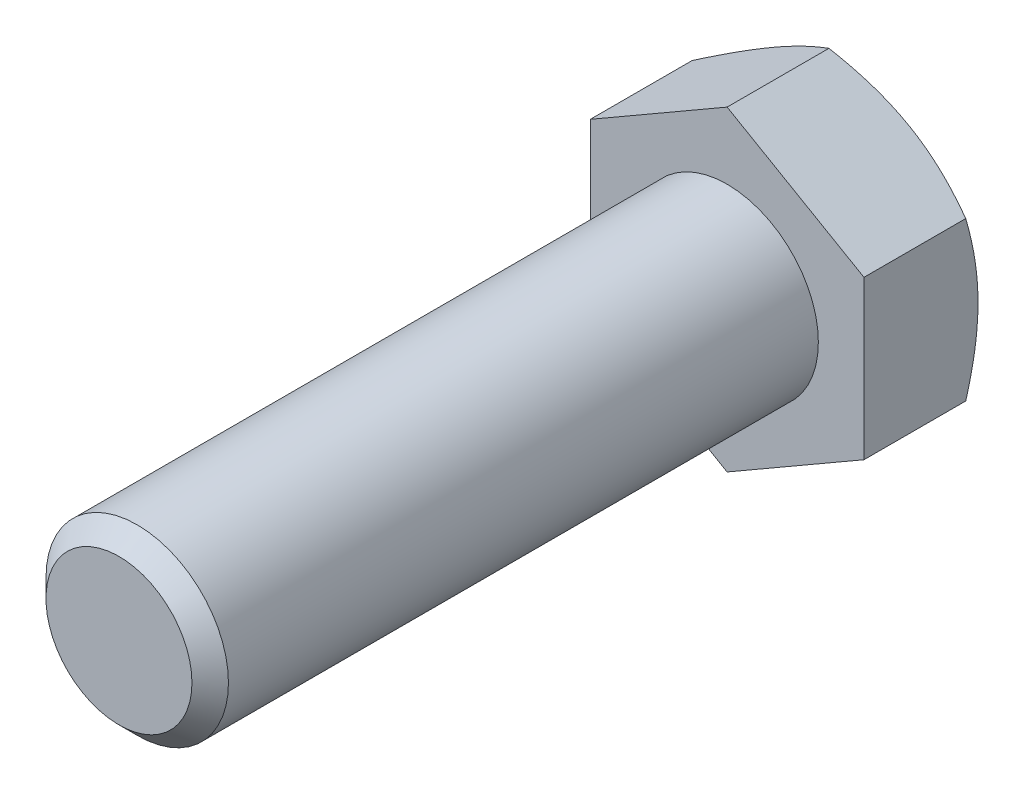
ISO-10303-21;
HEADER;
FILE_DESCRIPTION(('STEP AP214'),'2;1');
FILE_NAME('part.step','',(''),(''),'','','');
FILE_SCHEMA(('AUTOMOTIVE_DESIGN { 1 0 10303 214 1 1 1 1 }'));
ENDSEC;
DATA;
#1=APPLICATION_CONTEXT('core data for automotive mechanical design processes');
#2=APPLICATION_PROTOCOL_DEFINITION('international standard','automotive_design',2000,#1);
#3=PRODUCT_CONTEXT('',#1,'mechanical');
#4=PRODUCT('Part','Part','',(#3));
#5=PRODUCT_RELATED_PRODUCT_CATEGORY('part','',(#4));
#6=PRODUCT_DEFINITION_FORMATION('','',#4);
#7=PRODUCT_DEFINITION_CONTEXT('part definition',#1,'design');
#8=PRODUCT_DEFINITION('design','',#6,#7);
#9=PRODUCT_DEFINITION_SHAPE('','',#8);
#10=(LENGTH_UNIT() NAMED_UNIT(*) SI_UNIT(.MILLI.,.METRE.));
#11=(NAMED_UNIT(*) PLANE_ANGLE_UNIT() SI_UNIT($,.RADIAN.));
#12=(NAMED_UNIT(*) SI_UNIT($,.STERADIAN.) SOLID_ANGLE_UNIT());
#13=UNCERTAINTY_MEASURE_WITH_UNIT(LENGTH_MEASURE(1.E-05),#10,'distance_accuracy_value','');
#14=(GEOMETRIC_REPRESENTATION_CONTEXT(3) GLOBAL_UNCERTAINTY_ASSIGNED_CONTEXT((#13)) GLOBAL_UNIT_ASSIGNED_CONTEXT((#10,
#11,#12)) REPRESENTATION_CONTEXT('',''));
#15=CARTESIAN_POINT('',(0.,0.,0.));
#16=DIRECTION('',(0.,0.,1.));
#17=DIRECTION('',(1.,0.,0.));
#18=AXIS2_PLACEMENT_3D('',#15,#16,#17);
#19=CARTESIAN_POINT('',(0.,0.,40.));
#20=DIRECTION('',(0.,0.,1.));
#21=DIRECTION('',(1.,0.,0.));
#22=AXIS2_PLACEMENT_3D('',#19,#20,#21);
#23=PLANE('',#22);
#24=CARTESIAN_POINT('',(0.,0.,40.));
#25=DIRECTION('',(0.,0.,1.));
#26=DIRECTION('',(1.,0.,0.));
#27=AXIS2_PLACEMENT_3D('',#24,#25,#26);
#28=CIRCLE('',#27,4.8);
#29=CARTESIAN_POINT('',(4.80000000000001,0.,40.));
#30=VERTEX_POINT('',#29);
#31=EDGE_CURVE('E214',#30,#30,#28,.T.);
#32=ORIENTED_EDGE('',*,*,#31,.T.);
#33=EDGE_LOOP('',(#32));
#34=FACE_BOUND('',#33,.T.);
#35=ADVANCED_FACE('F34',(#34),#23,.T.);
#36=CARTESIAN_POINT('',(0.,0.,0.));
#37=DIRECTION('',(0.,0.,1.));
#38=DIRECTION('',(1.,0.,0.));
#39=AXIS2_PLACEMENT_3D('',#36,#37,#38);
#40=CYLINDRICAL_SURFACE('',#39,6.);
#41=CARTESIAN_POINT('',(0.,0.,38.8));
#42=DIRECTION('',(0.,0.,1.));
#43=DIRECTION('',(1.,0.,0.));
#44=AXIS2_PLACEMENT_3D('',#41,#42,#43);
#45=CIRCLE('',#44,6.);
#46=CARTESIAN_POINT('',(6.,0.,38.8));
#47=VERTEX_POINT('',#46);
#48=EDGE_CURVE('E216',#47,#47,#45,.F.);
#49=ORIENTED_EDGE('',*,*,#48,.T.);
#50=EDGE_LOOP('',(#49));
#51=FACE_BOUND('',#50,.T.);
#52=CARTESIAN_POINT('',(0.,0.,0.));
#53=DIRECTION('',(0.,0.,1.));
#54=DIRECTION('',(1.,0.,0.));
#55=AXIS2_PLACEMENT_3D('',#52,#53,#54);
#56=CIRCLE('',#55,6.);
#57=CARTESIAN_POINT('',(6.,0.,0.));
#58=VERTEX_POINT('',#57);
#59=EDGE_CURVE('E217',#58,#58,#56,.F.);
#60=ORIENTED_EDGE('',*,*,#59,.F.);
#61=EDGE_LOOP('',(#60));
#62=FACE_BOUND('',#61,.T.);
#63=ADVANCED_FACE('F205',(#51,#62),#40,.T.);
#64=CARTESIAN_POINT('',(0.,0.,40.));
#65=DIRECTION('',(0.,0.,-1.));
#66=DIRECTION('',(-1.,0.,0.));
#67=AXIS2_PLACEMENT_3D('',#64,#65,#66);
#68=CONICAL_SURFACE('',#67,4.8,0.785398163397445);
#69=ORIENTED_EDGE('',*,*,#48,.F.);
#70=EDGE_LOOP('',(#69));
#71=FACE_BOUND('',#70,.T.);
#72=ORIENTED_EDGE('',*,*,#31,.F.);
#73=EDGE_LOOP('',(#72));
#74=FACE_BOUND('',#73,.T.);
#75=ADVANCED_FACE('F210',(#71,#74),#68,.T.);
#76=CARTESIAN_POINT('',(0.,10.3923048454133,-7.5));
#77=DIRECTION('',(0.499999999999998,0.86602540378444,0.));
#78=DIRECTION('',(-0.86602540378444,0.499999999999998,0.));
#79=AXIS2_PLACEMENT_3D('',#76,#77,#78);
#80=PLANE('',#79);
#81=CARTESIAN_POINT('',(-0.000200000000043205,10.3924203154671,-6.69608575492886));
#82=CARTESIAN_POINT('',(0.197607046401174,10.2782163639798,-6.76201799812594));
#83=CARTESIAN_POINT('',(0.396185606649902,10.1635669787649,-6.82495859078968));
#84=CARTESIAN_POINT('',(0.794955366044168,9.93333715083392,-6.94403100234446));
#85=CARTESIAN_POINT('',(0.99514722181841,9.81775632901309,-7.00015988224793));
#86=CARTESIAN_POINT('',(1.39751505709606,9.58544915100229,-7.10484803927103));
#87=CARTESIAN_POINT('',(1.59969459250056,9.46872074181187,-7.15338922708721));
#88=CARTESIAN_POINT('',(2.00542875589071,9.23447001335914,-7.24185148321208));
#89=CARTESIAN_POINT('',(2.20898309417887,9.11694786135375,-7.28177431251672));
#90=CARTESIAN_POINT('',(2.61230590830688,8.88408932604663,-7.35131532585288));
#91=CARTESIAN_POINT('',(2.81204459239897,8.76877014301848,-7.3811624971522));
#92=CARTESIAN_POINT('',(3.21241567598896,8.53761579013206,-7.43120669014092));
#93=CARTESIAN_POINT('',(3.41304799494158,8.42178066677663,-7.45140456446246));
#94=CARTESIAN_POINT('',(3.81466063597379,8.18990950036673,-7.48164565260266));
#95=CARTESIAN_POINT('',(4.01564030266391,8.07387383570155,-7.4917003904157));
#96=CARTESIAN_POINT('',(4.4177845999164,7.84169571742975,-7.50143766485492));
#97=CARTESIAN_POINT('',(4.6189492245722,7.7255532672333,-7.50112052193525));
#98=CARTESIAN_POINT('',(4.99503261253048,7.50842142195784,-7.49083604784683));
#99=CARTESIAN_POINT('',(5.16997789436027,7.40741671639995,-7.48212325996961));
#100=CARTESIAN_POINT('',(5.51945867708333,7.2056438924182,-7.45702265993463));
#101=CARTESIAN_POINT('',(5.69399414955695,7.10487579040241,-7.44063433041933));
#102=CARTESIAN_POINT('',(6.21692487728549,6.80296159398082,-7.38034344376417));
#103=CARTESIAN_POINT('',(6.5643945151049,6.60234990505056,-7.32532251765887));
#104=CARTESIAN_POINT('',(7.26301962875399,6.19899850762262,-7.18776952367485));
#105=CARTESIAN_POINT('',(7.61408594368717,5.99631027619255,-7.10465438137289));
#106=CARTESIAN_POINT('',(8.3109833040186,5.59395639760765,-6.91601746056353));
#107=CARTESIAN_POINT('',(8.65682327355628,5.39428559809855,-6.81053998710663));
#108=CARTESIAN_POINT('',(9.0002,5.19603695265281,-6.69608575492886));
#109=B_SPLINE_CURVE_WITH_KNOTS('',3,(#81,#82,#83,#84,#85,#86,#87,#88,#89,#90,#91,#92,#93,#94,
#95,#96,#97,#98,#99,#100,#101,#102,#103,#104,#105,#106,#107,#108),.UNSPECIFIED.,.F.,.F.,(4,2,2,
2,2,2,2,2,2,2,2,2,2,4),(0.,0.713219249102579,1.42674513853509,2.14194697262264,2.85700253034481,
3.55449749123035,4.25193080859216,4.94857085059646,5.64518936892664,6.25162976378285,
6.85811104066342,8.07193747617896,9.31268391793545,10.5509947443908),.UNSPECIFIED.);
#110=CARTESIAN_POINT('',(0.,10.3923048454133,-6.69615242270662));
#111=VERTEX_POINT('',#110);
#112=CARTESIAN_POINT('',(4.49999999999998,7.79422863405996,-7.5));
#113=VERTEX_POINT('',#112);
#114=EDGE_CURVE('E250',#111,#113,#109,.T.);
#115=ORIENTED_EDGE('',*,*,#114,.F.);
#116=DIRECTION('',(0.,0.,1.));
#117=VECTOR('',#116,1.);
#118=CARTESIAN_POINT('',(0.,10.3923048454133,-7.5));
#119=LINE('',#118,#117);
#120=CARTESIAN_POINT('',(0.,10.3923048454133,0.));
#121=VERTEX_POINT('',#120);
#122=EDGE_CURVE('E224',#111,#121,#119,.T.);
#123=ORIENTED_EDGE('',*,*,#122,.T.);
#124=DIRECTION('',(-0.86602540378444,0.499999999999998,0.));
#125=VECTOR('',#124,1.);
#126=CARTESIAN_POINT('',(0.,10.3923048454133,0.));
#127=LINE('',#126,#125);
#128=CARTESIAN_POINT('',(9.,5.19615242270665,0.));
#129=VERTEX_POINT('',#128);
#130=EDGE_CURVE('E248',#129,#121,#127,.T.);
#131=ORIENTED_EDGE('',*,*,#130,.F.);
#132=DIRECTION('',(0.,0.,1.));
#133=VECTOR('',#132,1.);
#134=CARTESIAN_POINT('',(9.,5.19615242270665,-7.5));
#135=LINE('',#134,#133);
#136=CARTESIAN_POINT('',(9.,5.19615242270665,-6.69615242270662));
#137=VERTEX_POINT('',#136);
#138=EDGE_CURVE('E221',#137,#129,#135,.T.);
#139=ORIENTED_EDGE('',*,*,#138,.F.);
#140=EDGE_CURVE('E179',#113,#137,#109,.T.);
#141=ORIENTED_EDGE('',*,*,#140,.F.);
#142=EDGE_LOOP('',(#115,#123,#131,#139,#141));
#143=FACE_BOUND('',#142,.T.);
#144=ADVANCED_FACE('F190',(#143),#80,.T.);
#145=CARTESIAN_POINT('',(9.,-5.19615242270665,-7.5));
#146=DIRECTION('',(1.,0.,0.));
#147=DIRECTION('',(0.,0.,-1.));
#148=AXIS2_PLACEMENT_3D('',#145,#146,#147);
#149=PLANE('',#148);
#150=CARTESIAN_POINT('',(9.,-14.1938054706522,-2.9928177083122));
#151=CARTESIAN_POINT('',(9.,-13.7986249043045,-3.18545400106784));
#152=CARTESIAN_POINT('',(9.,-13.4025620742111,-3.37631016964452));
#153=CARTESIAN_POINT('',(9.,-12.6082034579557,-3.75346543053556));
#154=CARTESIAN_POINT('',(9.,-12.2099073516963,-3.93976384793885));
#155=CARTESIAN_POINT('',(9.,-11.4086732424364,-4.30769386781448));
#156=CARTESIAN_POINT('',(9.,-11.005721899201,-4.48929651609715));
#157=CARTESIAN_POINT('',(9.,-10.1966954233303,-4.84537774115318));
#158=CARTESIAN_POINT('',(9.,-9.79062043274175,-5.01985663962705));
#159=CARTESIAN_POINT('',(9.,-8.96081603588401,-5.36560228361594));
#160=CARTESIAN_POINT('',(9.,-8.53695616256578,-5.53655757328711));
#161=CARTESIAN_POINT('',(9.,-7.68436682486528,-5.86609252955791));
#162=CARTESIAN_POINT('',(9.,-7.25563683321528,-6.02467084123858));
#163=CARTESIAN_POINT('',(9.,-6.39334839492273,-6.3254614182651));
#164=CARTESIAN_POINT('',(9.,-5.95980093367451,-6.46770484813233));
#165=CARTESIAN_POINT('',(9.,-5.08650675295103,-6.73142002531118));
#166=CARTESIAN_POINT('',(9.,-4.64676195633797,-6.85289806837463));
#167=CARTESIAN_POINT('',(9.,-3.76318857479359,-7.06875933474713));
#168=CARTESIAN_POINT('',(9.,-3.31939822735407,-7.16329494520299));
#169=CARTESIAN_POINT('',(9.,-2.64948950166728,-7.28091249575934));
#170=CARTESIAN_POINT('',(9.,-2.42546830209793,-7.31608884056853));
#171=CARTESIAN_POINT('',(9.,-1.97623392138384,-7.37769613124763));
#172=CARTESIAN_POINT('',(9.,-1.75102085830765,-7.40412792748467));
#173=CARTESIAN_POINT('',(9.,-1.3027498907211,-7.44737513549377));
#174=CARTESIAN_POINT('',(9.,-1.07970414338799,-7.46431601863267));
#175=CARTESIAN_POINT('',(9.,-0.633095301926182,-7.4887410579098));
#176=CARTESIAN_POINT('',(9.,-0.409532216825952,-7.49622537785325));
#177=CARTESIAN_POINT('',(9.,0.0377121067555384,-7.50155767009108));
#178=CARTESIAN_POINT('',(9.,0.261393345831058,-7.49940559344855));
#179=CARTESIAN_POINT('',(9.,0.708460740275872,-7.48552018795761));
#180=CARTESIAN_POINT('',(9.,0.931846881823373,-7.47378642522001));
#181=CARTESIAN_POINT('',(9.,1.46162752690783,-7.43485039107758));
#182=CARTESIAN_POINT('',(9.,1.76772399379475,-7.40349650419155));
#183=CARTESIAN_POINT('',(9.,2.37778404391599,-7.32445593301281));
#184=CARTESIAN_POINT('',(9.,2.6817473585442,-7.27676722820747));
#185=CARTESIAN_POINT('',(9.,3.59000335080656,-7.1117163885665));
#186=CARTESIAN_POINT('',(9.,4.19036603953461,-6.9723942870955));
#187=CARTESIAN_POINT('',(9.,5.08858153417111,-6.72898039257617));
#188=CARTESIAN_POINT('',(9.,5.39104017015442,-6.64089135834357));
#189=CARTESIAN_POINT('',(9.,5.99302412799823,-6.4551143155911));
#190=CARTESIAN_POINT('',(9.,6.29254942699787,-6.35742623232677));
#191=CARTESIAN_POINT('',(9.,6.88875586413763,-6.15405553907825));
#192=CARTESIAN_POINT('',(9.,7.18543776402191,-6.0483751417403));
#193=CARTESIAN_POINT('',(9.,7.77631041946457,-5.83030807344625));
#194=CARTESIAN_POINT('',(9.,8.07050123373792,-5.71792156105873));
#195=CARTESIAN_POINT('',(9.,8.86768097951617,-5.40462740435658));
#196=CARTESIAN_POINT('',(9.,9.36851420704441,-5.19823951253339));
#197=CARTESIAN_POINT('',(9.,10.3649647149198,-4.77318997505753));
#198=CARTESIAN_POINT('',(9.,10.860581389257,-4.5545269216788));
#199=CARTESIAN_POINT('',(9.,11.8478077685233,-4.10785524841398));
#200=CARTESIAN_POINT('',(9.,12.3394158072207,-3.87984295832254));
#201=CARTESIAN_POINT('',(9.,13.3192435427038,-3.41672758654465));
#202=CARTESIAN_POINT('',(9.,13.8074633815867,-3.18162480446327));
#203=CARTESIAN_POINT('',(9.,14.7819931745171,-2.70549247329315));
#204=CARTESIAN_POINT('',(9.,15.2682986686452,-2.46445381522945));
#205=CARTESIAN_POINT('',(9.,16.2387067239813,-1.97797920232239));
#206=CARTESIAN_POINT('',(9.,16.722809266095,-1.73254320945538));
#207=CARTESIAN_POINT('',(9.,17.6890969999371,-1.23819989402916));
#208=CARTESIAN_POINT('',(9.,18.1712826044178,-0.98929337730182));
#209=CARTESIAN_POINT('',(9.,19.1341609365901,-0.488607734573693));
#210=CARTESIAN_POINT('',(9.,19.6148536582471,-0.236828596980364));
#211=CARTESIAN_POINT('',(9.,20.9522159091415,0.467839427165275));
#212=CARTESIAN_POINT('',(9.,21.8075292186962,0.923301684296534));
#213=CARTESIAN_POINT('',(9.,23.5152984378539,1.83966951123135));
#214=CARTESIAN_POINT('',(9.,24.3677541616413,2.30057542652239));
#215=CARTESIAN_POINT('',(9.,26.0675482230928,3.22485857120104));
#216=CARTESIAN_POINT('',(9.,26.9148940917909,3.68822195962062));
#217=CARTESIAN_POINT('',(9.,28.1846057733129,4.38556367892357));
#218=CARTESIAN_POINT('',(9.,28.6076082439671,4.61838432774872));
#219=CARTESIAN_POINT('',(9.,29.4532343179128,5.08471147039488));
#220=CARTESIAN_POINT('',(9.,29.8758579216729,5.31821796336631));
#221=CARTESIAN_POINT('',(9.,30.2983153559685,5.55202477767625));
#222=B_SPLINE_CURVE_WITH_KNOTS('',3,(#150,#151,#152,#153,#154,#155,#156,#157,#158,#159,#160,
#161,#162,#163,#164,#165,#166,#167,#168,#169,#170,#171,#172,#173,#174,#175,#176,#177,#178,#179,
#180,#181,#182,#183,#184,#185,#186,#187,#188,#189,#190,#191,#192,#193,#194,#195,#196,#197,#198,
#199,#200,#201,#202,#203,#204,#205,#206,#207,#208,#209,#210,#211,#212,#213,#214,#215,#216,#217,
#218,#219,#220,#221),.UNSPECIFIED.,.F.,.F.,(4,2,2,2,2,2,2,2,2,2,2,2,2,2,2,2,2,2,2,2,2,2,2,2,2,2,
2,2,2,2,2,2,2,2,2,4),(0.,1.31891143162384,2.63801699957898,3.9639117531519,5.28974656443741,
6.66070766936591,8.03181864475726,9.40026868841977,10.7683030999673,12.1284389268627,
12.8085936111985,13.488682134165,14.1595537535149,14.8304137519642,15.5012771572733,
16.172170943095,17.094749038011,18.0174412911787,19.8637129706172,20.808703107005,
21.7537006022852,22.6984374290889,23.6431519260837,25.267980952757,26.8929966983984,
28.5186565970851,30.1442479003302,31.7725119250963,33.400790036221,35.0286961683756,
36.6566088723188,39.5636489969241,42.4708746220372,45.3681585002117,46.8166845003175,
48.2652087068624),.UNSPECIFIED.);
#223=CARTESIAN_POINT('',(9.,0.,-7.5));
#224=VERTEX_POINT('',#223);
#225=EDGE_CURVE('E177',#137,#224,#222,.F.);
#226=ORIENTED_EDGE('',*,*,#225,.F.);
#227=ORIENTED_EDGE('',*,*,#138,.T.);
#228=DIRECTION('',(0.,1.,0.));
#229=VECTOR('',#228,1.);
#230=CARTESIAN_POINT('',(9.,-5.19615242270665,0.));
#231=LINE('',#230,#229);
#232=CARTESIAN_POINT('',(9.,-5.19615242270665,0.));
#233=VERTEX_POINT('',#232);
#234=EDGE_CURVE('E226',#233,#129,#231,.T.);
#235=ORIENTED_EDGE('',*,*,#234,.F.);
#236=DIRECTION('',(0.,0.,1.));
#237=VECTOR('',#236,1.);
#238=CARTESIAN_POINT('',(9.,-5.19615242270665,-7.5));
#239=LINE('',#238,#237);
#240=CARTESIAN_POINT('',(9.,-5.19615242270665,-6.69615242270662));
#241=VERTEX_POINT('',#240);
#242=EDGE_CURVE('E232',#241,#233,#239,.T.);
#243=ORIENTED_EDGE('',*,*,#242,.F.);
#244=EDGE_CURVE('E171',#224,#241,#222,.F.);
#245=ORIENTED_EDGE('',*,*,#244,.F.);
#246=EDGE_LOOP('',(#226,#227,#235,#243,#245));
#247=FACE_BOUND('',#246,.T.);
#248=ADVANCED_FACE('F186',(#247),#149,.T.);
#249=CARTESIAN_POINT('',(0.,-10.3923048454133,-7.5));
#250=DIRECTION('',(0.499999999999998,-0.86602540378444,0.));
#251=DIRECTION('',(0.86602540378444,0.499999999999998,0.));
#252=AXIS2_PLACEMENT_3D('',#249,#250,#251);
#253=PLANE('',#252);
#254=CARTESIAN_POINT('',(9.0002,-5.19603695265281,-6.69608575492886));
#255=CARTESIAN_POINT('',(8.80239295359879,-5.31024090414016,-6.76201799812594));
#256=CARTESIAN_POINT('',(8.60381439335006,-5.42489028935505,-6.82495859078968));
#257=CARTESIAN_POINT('',(8.20504463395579,-5.65512011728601,-6.94403100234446));
#258=CARTESIAN_POINT('',(8.00485277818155,-5.77070093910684,-7.00015988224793));
#259=CARTESIAN_POINT('',(7.6024849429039,-6.00300811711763,-7.10484803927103));
#260=CARTESIAN_POINT('',(7.4003054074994,-6.11973652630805,-7.15338922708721));
#261=CARTESIAN_POINT('',(6.99457124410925,-6.35398725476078,-7.24185148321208));
#262=CARTESIAN_POINT('',(6.79101690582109,-6.47150940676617,-7.28177431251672));
#263=CARTESIAN_POINT('',(6.38769409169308,-6.70436794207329,-7.35131532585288));
#264=CARTESIAN_POINT('',(6.18795540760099,-6.81968712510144,-7.3811624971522));
#265=CARTESIAN_POINT('',(5.787584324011,-7.05084147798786,-7.43120669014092));
#266=CARTESIAN_POINT('',(5.58695200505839,-7.16667660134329,-7.45140456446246));
#267=CARTESIAN_POINT('',(5.18533936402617,-7.3985477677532,-7.48164565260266));
#268=CARTESIAN_POINT('',(4.98435969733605,-7.51458343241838,-7.4917003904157));
#269=CARTESIAN_POINT('',(4.58221540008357,-7.74676155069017,-7.50143766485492));
#270=CARTESIAN_POINT('',(4.38105077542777,-7.86290400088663,-7.50112052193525));
#271=CARTESIAN_POINT('',(4.00496738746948,-8.08003584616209,-7.49083604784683));
#272=CARTESIAN_POINT('',(3.83002210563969,-8.18104055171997,-7.48212325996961));
#273=CARTESIAN_POINT('',(3.48054132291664,-8.38281337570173,-7.45702265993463));
#274=CARTESIAN_POINT('',(3.30600585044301,-8.48358147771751,-7.44063433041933));
#275=CARTESIAN_POINT('',(2.78307512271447,-8.78549567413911,-7.38034344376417));
#276=CARTESIAN_POINT('',(2.43560548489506,-8.98610736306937,-7.32532251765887));
#277=CARTESIAN_POINT('',(1.73698037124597,-9.3894587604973,-7.18776952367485));
#278=CARTESIAN_POINT('',(1.3859140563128,-9.59214699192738,-7.10465438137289));
#279=CARTESIAN_POINT('',(0.689016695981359,-9.99450087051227,-6.91601746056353));
#280=CARTESIAN_POINT('',(0.343176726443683,-10.1941716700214,-6.81053998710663));
#281=CARTESIAN_POINT('',(-0.000200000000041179,-10.3924203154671,-6.69608575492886));
#282=B_SPLINE_CURVE_WITH_KNOTS('',3,(#254,#255,#256,#257,#258,#259,#260,#261,#262,#263,#264,
#265,#266,#267,#268,#269,#270,#271,#272,#273,#274,#275,#276,#277,#278,#279,#280,#281),
.UNSPECIFIED.,.F.,.F.,(4,2,2,2,2,2,2,2,2,2,2,2,2,4),(0.,0.713219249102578,1.42674513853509,
2.14194697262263,2.85700253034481,3.55449749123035,4.25193080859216,4.94857085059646,
5.64518936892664,6.25162976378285,6.85811104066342,8.07193747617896,9.31268391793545,
10.5509947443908),.UNSPECIFIED.);
#283=CARTESIAN_POINT('',(4.49999999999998,-7.79422863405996,-7.5));
#284=VERTEX_POINT('',#283);
#285=EDGE_CURVE('E178',#241,#284,#282,.T.);
#286=ORIENTED_EDGE('',*,*,#285,.F.);
#287=ORIENTED_EDGE('',*,*,#242,.T.);
#288=DIRECTION('',(0.86602540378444,0.499999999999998,0.));
#289=VECTOR('',#288,1.);
#290=CARTESIAN_POINT('',(0.,-10.3923048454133,0.));
#291=LINE('',#290,#289);
#292=CARTESIAN_POINT('',(0.,-10.3923048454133,0.));
#293=VERTEX_POINT('',#292);
#294=EDGE_CURVE('E237',#293,#233,#291,.T.);
#295=ORIENTED_EDGE('',*,*,#294,.F.);
#296=DIRECTION('',(0.,0.,1.));
#297=VECTOR('',#296,1.);
#298=CARTESIAN_POINT('',(0.,-10.3923048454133,-7.5));
#299=LINE('',#298,#297);
#300=CARTESIAN_POINT('',(0.,-10.3923048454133,-6.69615242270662));
#301=VERTEX_POINT('',#300);
#302=EDGE_CURVE('E230',#301,#293,#299,.T.);
#303=ORIENTED_EDGE('',*,*,#302,.F.);
#304=EDGE_CURVE('E164',#284,#301,#282,.T.);
#305=ORIENTED_EDGE('',*,*,#304,.F.);
#306=EDGE_LOOP('',(#286,#287,#295,#303,#305));
#307=FACE_BOUND('',#306,.T.);
#308=ADVANCED_FACE('F189',(#307),#253,.T.);
#309=CARTESIAN_POINT('',(0.,-10.3923048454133,-7.5));
#310=DIRECTION('',(-0.500000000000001,-0.866025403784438,0.));
#311=DIRECTION('',(0.866025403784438,-0.500000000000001,0.));
#312=AXIS2_PLACEMENT_3D('',#309,#310,#311);
#313=PLANE('',#312);
#314=CARTESIAN_POINT('',(0.000199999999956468,-10.3924203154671,-6.69608575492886));
#315=CARTESIAN_POINT('',(-0.19760704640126,-10.2782163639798,-6.76201799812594));
#316=CARTESIAN_POINT('',(-0.396185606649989,-10.1635669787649,-6.82495859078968));
#317=CARTESIAN_POINT('',(-0.794955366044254,-9.93333715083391,-6.94403100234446));
#318=CARTESIAN_POINT('',(-0.995147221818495,-9.81775632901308,-7.00015988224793));
#319=CARTESIAN_POINT('',(-1.39751505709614,-9.58544915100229,-7.10484803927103));
#320=CARTESIAN_POINT('',(-1.59969459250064,-9.46872074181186,-7.15338922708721));
#321=CARTESIAN_POINT('',(-2.00542875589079,-9.23447001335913,-7.24185148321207));
#322=CARTESIAN_POINT('',(-2.20898309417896,-9.11694786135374,-7.28177431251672));
#323=CARTESIAN_POINT('',(-2.61230590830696,-8.88408932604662,-7.35131532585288));
#324=CARTESIAN_POINT('',(-2.81204459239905,-8.76877014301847,-7.38116249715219));
#325=CARTESIAN_POINT('',(-3.21241567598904,-8.53761579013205,-7.43120669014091));
#326=CARTESIAN_POINT('',(-3.41304799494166,-8.42178066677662,-7.45140456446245));
#327=CARTESIAN_POINT('',(-3.81466063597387,-8.18990950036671,-7.48164565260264));
#328=CARTESIAN_POINT('',(-4.01564030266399,-8.07387383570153,-7.49170039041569));
#329=CARTESIAN_POINT('',(-4.41778459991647,-7.84169571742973,-7.50143766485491));
#330=CARTESIAN_POINT('',(-4.61894922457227,-7.72555326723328,-7.50112052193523));
#331=CARTESIAN_POINT('',(-4.99503261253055,-7.50842142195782,-7.49083604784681));
#332=CARTESIAN_POINT('',(-5.16997789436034,-7.40741671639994,-7.48212325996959));
#333=CARTESIAN_POINT('',(-5.51945867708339,-7.20564389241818,-7.45702265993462));
#334=CARTESIAN_POINT('',(-5.69399414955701,-7.10487579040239,-7.44063433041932));
#335=CARTESIAN_POINT('',(-6.21692487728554,-6.8029615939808,-7.38034344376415));
#336=CARTESIAN_POINT('',(-6.56439451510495,-6.60234990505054,-7.32532251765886));
#337=CARTESIAN_POINT('',(-7.26301962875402,-6.19899850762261,-7.18776952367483));
#338=CARTESIAN_POINT('',(-7.61408594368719,-5.99631027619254,-7.10465438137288));
#339=CARTESIAN_POINT('',(-8.31098330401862,-5.59395639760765,-6.91601746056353));
#340=CARTESIAN_POINT('',(-8.65682327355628,-5.39428559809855,-6.81053998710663));
#341=CARTESIAN_POINT('',(-9.0002,-5.19603695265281,-6.69608575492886));
#342=B_SPLINE_CURVE_WITH_KNOTS('',3,(#314,#315,#316,#317,#318,#319,#320,#321,#322,#323,#324,
#325,#326,#327,#328,#329,#330,#331,#332,#333,#334,#335,#336,#337,#338,#339,#340,#341),
.UNSPECIFIED.,.F.,.F.,(4,2,2,2,2,2,2,2,2,2,2,2,2,4),(0.,0.71321924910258,1.42674513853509,
2.14194697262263,2.85700253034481,3.55449749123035,4.25193080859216,4.94857085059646,
5.64518936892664,6.25162976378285,6.85811104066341,8.07193747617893,9.31268391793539,
10.5509947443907),.UNSPECIFIED.);
#343=CARTESIAN_POINT('',(-4.50000000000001,-7.79422863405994,-7.5));
#344=VERTEX_POINT('',#343);
#345=EDGE_CURVE('E269',#301,#344,#342,.T.);
#346=ORIENTED_EDGE('',*,*,#345,.F.);
#347=ORIENTED_EDGE('',*,*,#302,.T.);
#348=DIRECTION('',(0.866025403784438,-0.500000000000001,0.));
#349=VECTOR('',#348,1.);
#350=CARTESIAN_POINT('',(0.,-10.3923048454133,0.));
#351=LINE('',#350,#349);
#352=CARTESIAN_POINT('',(-9.,-5.19615242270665,0.));
#353=VERTEX_POINT('',#352);
#354=EDGE_CURVE('E240',#353,#293,#351,.T.);
#355=ORIENTED_EDGE('',*,*,#354,.F.);
#356=DIRECTION('',(0.,0.,1.));
#357=VECTOR('',#356,1.);
#358=CARTESIAN_POINT('',(-9.,-5.19615242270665,-7.5));
#359=LINE('',#358,#357);
#360=CARTESIAN_POINT('',(-9.,-5.19615242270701,-6.69615242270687));
#361=VERTEX_POINT('',#360);
#362=EDGE_CURVE('E228',#361,#353,#359,.T.);
#363=ORIENTED_EDGE('',*,*,#362,.F.);
#364=EDGE_CURVE('E110',#344,#361,#342,.T.);
#365=ORIENTED_EDGE('',*,*,#364,.F.);
#366=EDGE_LOOP('',(#346,#347,#355,#363,#365));
#367=FACE_BOUND('',#366,.T.);
#368=ADVANCED_FACE('F194',(#367),#313,.T.);
#369=CARTESIAN_POINT('',(-9.,-5.19615242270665,-7.5));
#370=DIRECTION('',(-1.,0.,0.));
#371=DIRECTION('',(0.,0.,1.));
#372=AXIS2_PLACEMENT_3D('',#369,#370,#371);
#373=PLANE('',#372);
#374=CARTESIAN_POINT('',(-9.,-14.1938054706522,-2.99281770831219));
#375=CARTESIAN_POINT('',(-9.,-13.7986249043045,-3.18545400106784));
#376=CARTESIAN_POINT('',(-9.,-13.4025620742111,-3.37631016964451));
#377=CARTESIAN_POINT('',(-9.,-12.6082034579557,-3.75346543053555));
#378=CARTESIAN_POINT('',(-9.,-12.2099073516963,-3.93976384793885));
#379=CARTESIAN_POINT('',(-9.,-11.4086732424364,-4.30769386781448));
#380=CARTESIAN_POINT('',(-9.,-11.005721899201,-4.48929651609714));
#381=CARTESIAN_POINT('',(-9.,-10.1966954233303,-4.84537774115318));
#382=CARTESIAN_POINT('',(-9.,-9.79062043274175,-5.01985663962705));
#383=CARTESIAN_POINT('',(-9.,-8.96081603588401,-5.36560228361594));
#384=CARTESIAN_POINT('',(-9.,-8.53695616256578,-5.53655757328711));
#385=CARTESIAN_POINT('',(-9.,-7.68436682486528,-5.86609252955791));
#386=CARTESIAN_POINT('',(-9.,-7.25563683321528,-6.02467084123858));
#387=CARTESIAN_POINT('',(-9.,-6.39334839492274,-6.3254614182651));
#388=CARTESIAN_POINT('',(-9.,-5.95980093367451,-6.46770484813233));
#389=CARTESIAN_POINT('',(-9.,-5.08650675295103,-6.73142002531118));
#390=CARTESIAN_POINT('',(-9.,-4.64676195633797,-6.85289806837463));
#391=CARTESIAN_POINT('',(-9.,-3.7631885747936,-7.06875933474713));
#392=CARTESIAN_POINT('',(-9.,-3.31939822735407,-7.16329494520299));
#393=CARTESIAN_POINT('',(-9.,-2.64948950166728,-7.28091249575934));
#394=CARTESIAN_POINT('',(-9.,-2.42546830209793,-7.31608884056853));
#395=CARTESIAN_POINT('',(-9.,-1.97623392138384,-7.37769613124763));
#396=CARTESIAN_POINT('',(-9.,-1.75102085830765,-7.40412792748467));
#397=CARTESIAN_POINT('',(-9.,-1.30274989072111,-7.44737513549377));
#398=CARTESIAN_POINT('',(-9.,-1.07970414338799,-7.46431601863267));
#399=CARTESIAN_POINT('',(-9.,-0.633095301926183,-7.4887410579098));
#400=CARTESIAN_POINT('',(-9.,-0.409532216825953,-7.49622537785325));
#401=CARTESIAN_POINT('',(-9.,0.037712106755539,-7.50155767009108));
#402=CARTESIAN_POINT('',(-9.,0.261393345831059,-7.49940559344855));
#403=CARTESIAN_POINT('',(-9.,0.708460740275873,-7.48552018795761));
#404=CARTESIAN_POINT('',(-9.,0.931846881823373,-7.47378642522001));
#405=CARTESIAN_POINT('',(-9.,1.46162752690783,-7.43485039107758));
#406=CARTESIAN_POINT('',(-9.,1.76772399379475,-7.40349650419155));
#407=CARTESIAN_POINT('',(-9.,2.37778404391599,-7.32445593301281));
#408=CARTESIAN_POINT('',(-9.,2.6817473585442,-7.27676722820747));
#409=CARTESIAN_POINT('',(-9.,3.59000335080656,-7.1117163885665));
#410=CARTESIAN_POINT('',(-9.,4.19036603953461,-6.9723942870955));
#411=CARTESIAN_POINT('',(-9.,5.08858153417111,-6.72898039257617));
#412=CARTESIAN_POINT('',(-9.,5.39104017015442,-6.64089135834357));
#413=CARTESIAN_POINT('',(-9.,5.99302412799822,-6.4551143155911));
#414=CARTESIAN_POINT('',(-9.,6.29254942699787,-6.35742623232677));
#415=CARTESIAN_POINT('',(-9.,6.88875586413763,-6.15405553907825));
#416=CARTESIAN_POINT('',(-9.,7.18543776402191,-6.0483751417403));
#417=CARTESIAN_POINT('',(-9.,7.77631041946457,-5.83030807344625));
#418=CARTESIAN_POINT('',(-9.,8.07050123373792,-5.71792156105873));
#419=CARTESIAN_POINT('',(-9.,8.86768097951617,-5.40462740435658));
#420=CARTESIAN_POINT('',(-9.,9.3685142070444,-5.19823951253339));
#421=CARTESIAN_POINT('',(-9.,10.3649647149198,-4.77318997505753));
#422=CARTESIAN_POINT('',(-9.,10.860581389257,-4.5545269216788));
#423=CARTESIAN_POINT('',(-9.,11.8478077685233,-4.10785524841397));
#424=CARTESIAN_POINT('',(-9.,12.3394158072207,-3.87984295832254));
#425=CARTESIAN_POINT('',(-9.,13.3192435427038,-3.41672758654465));
#426=CARTESIAN_POINT('',(-9.,13.8074633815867,-3.18162480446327));
#427=CARTESIAN_POINT('',(-9.,14.7819931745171,-2.70549247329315));
#428=CARTESIAN_POINT('',(-9.,15.2682986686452,-2.46445381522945));
#429=CARTESIAN_POINT('',(-9.,16.2387067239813,-1.97797920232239));
#430=CARTESIAN_POINT('',(-9.,16.722809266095,-1.73254320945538));
#431=CARTESIAN_POINT('',(-9.,17.6890969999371,-1.23819989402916));
#432=CARTESIAN_POINT('',(-9.,18.1712826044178,-0.989293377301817));
#433=CARTESIAN_POINT('',(-9.,19.1341609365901,-0.488607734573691));
#434=CARTESIAN_POINT('',(-9.,19.6148536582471,-0.236828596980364));
#435=CARTESIAN_POINT('',(-9.,20.9522159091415,0.467839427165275));
#436=CARTESIAN_POINT('',(-9.,21.8075292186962,0.923301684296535));
#437=CARTESIAN_POINT('',(-9.,23.5152984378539,1.83966951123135));
#438=CARTESIAN_POINT('',(-9.,24.3677541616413,2.30057542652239));
#439=CARTESIAN_POINT('',(-9.,26.0675482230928,3.22485857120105));
#440=CARTESIAN_POINT('',(-9.,26.9148940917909,3.68822195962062));
#441=CARTESIAN_POINT('',(-9.,28.1846057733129,4.38556367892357));
#442=CARTESIAN_POINT('',(-9.,28.6076082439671,4.61838432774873));
#443=CARTESIAN_POINT('',(-9.,29.4532343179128,5.08471147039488));
#444=CARTESIAN_POINT('',(-9.,29.8758579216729,5.31821796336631));
#445=CARTESIAN_POINT('',(-9.,30.2983153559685,5.55202477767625));
#446=B_SPLINE_CURVE_WITH_KNOTS('',3,(#374,#375,#376,#377,#378,#379,#380,#381,#382,#383,#384,
#385,#386,#387,#388,#389,#390,#391,#392,#393,#394,#395,#396,#397,#398,#399,#400,#401,#402,#403,
#404,#405,#406,#407,#408,#409,#410,#411,#412,#413,#414,#415,#416,#417,#418,#419,#420,#421,#422,
#423,#424,#425,#426,#427,#428,#429,#430,#431,#432,#433,#434,#435,#436,#437,#438,#439,#440,#441,
#442,#443,#444,#445),.UNSPECIFIED.,.F.,.F.,(4,2,2,2,2,2,2,2,2,2,2,2,2,2,2,2,2,2,2,2,2,2,2,2,2,2,
2,2,2,2,2,2,2,2,2,4),(0.,1.31891143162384,2.63801699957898,3.9639117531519,5.28974656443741,
6.66070766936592,8.03181864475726,9.40026868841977,10.7683030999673,12.1284389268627,
12.8085936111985,13.488682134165,14.1595537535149,14.8304137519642,15.5012771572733,
16.172170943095,17.094749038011,18.0174412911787,19.8637129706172,20.808703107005,
21.7537006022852,22.6984374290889,23.6431519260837,25.267980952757,26.8929966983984,
28.5186565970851,30.1442479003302,31.7725119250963,33.400790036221,35.0286961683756,
36.6566088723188,39.5636489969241,42.4708746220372,45.3681585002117,46.8166845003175,
48.2652087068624),.UNSPECIFIED.);
#447=CARTESIAN_POINT('',(-9.00000000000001,0.,-7.5));
#448=VERTEX_POINT('',#447);
#449=EDGE_CURVE('E105',#361,#448,#446,.T.);
#450=ORIENTED_EDGE('',*,*,#449,.F.);
#451=ORIENTED_EDGE('',*,*,#362,.T.);
#452=DIRECTION('',(0.,-1.,0.));
#453=VECTOR('',#452,1.);
#454=CARTESIAN_POINT('',(-9.,-5.19615242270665,0.));
#455=LINE('',#454,#453);
#456=CARTESIAN_POINT('',(-9.,5.19615242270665,0.));
#457=VERTEX_POINT('',#456);
#458=EDGE_CURVE('E243',#457,#353,#455,.T.);
#459=ORIENTED_EDGE('',*,*,#458,.F.);
#460=DIRECTION('',(0.,0.,1.));
#461=VECTOR('',#460,1.);
#462=CARTESIAN_POINT('',(-9.,5.19615242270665,-7.5));
#463=LINE('',#462,#461);
#464=CARTESIAN_POINT('',(-9.,5.19615242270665,-6.69615242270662));
#465=VERTEX_POINT('',#464);
#466=EDGE_CURVE('E131',#465,#457,#463,.T.);
#467=ORIENTED_EDGE('',*,*,#466,.F.);
#468=EDGE_CURVE('E114',#448,#465,#446,.T.);
#469=ORIENTED_EDGE('',*,*,#468,.F.);
#470=EDGE_LOOP('',(#450,#451,#459,#467,#469));
#471=FACE_BOUND('',#470,.T.);
#472=ADVANCED_FACE('F129',(#471),#373,.T.);
#473=CARTESIAN_POINT('',(-9.,5.19615242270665,-7.5));
#474=DIRECTION('',(-0.500000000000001,0.866025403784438,0.));
#475=DIRECTION('',(-0.866025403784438,-0.500000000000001,0.));
#476=AXIS2_PLACEMENT_3D('',#473,#474,#475);
#477=PLANE('',#476);
#478=CARTESIAN_POINT('',(-9.0002,5.19603695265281,-6.69608575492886));
#479=CARTESIAN_POINT('',(-8.80239295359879,5.31024090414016,-6.76201799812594));
#480=CARTESIAN_POINT('',(-8.60381439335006,5.42489028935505,-6.82495859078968));
#481=CARTESIAN_POINT('',(-8.20504463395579,5.65512011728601,-6.94403100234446));
#482=CARTESIAN_POINT('',(-8.00485277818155,5.77070093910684,-7.00015988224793));
#483=CARTESIAN_POINT('',(-7.6024849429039,6.00300811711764,-7.10484803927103));
#484=CARTESIAN_POINT('',(-7.4003054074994,6.11973652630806,-7.15338922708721));
#485=CARTESIAN_POINT('',(-6.99457124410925,6.35398725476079,-7.24185148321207));
#486=CARTESIAN_POINT('',(-6.79101690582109,6.47150940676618,-7.28177431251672));
#487=CARTESIAN_POINT('',(-6.38769409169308,6.7043679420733,-7.35131532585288));
#488=CARTESIAN_POINT('',(-6.18795540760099,6.81968712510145,-7.38116249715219));
#489=CARTESIAN_POINT('',(-5.787584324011,7.05084147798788,-7.43120669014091));
#490=CARTESIAN_POINT('',(-5.58695200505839,7.16667660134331,-7.45140456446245));
#491=CARTESIAN_POINT('',(-5.18533936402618,7.39854776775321,-7.48164565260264));
#492=CARTESIAN_POINT('',(-4.98435969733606,7.51458343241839,-7.49170039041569));
#493=CARTESIAN_POINT('',(-4.58221540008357,7.74676155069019,-7.50143766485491));
#494=CARTESIAN_POINT('',(-4.38105077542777,7.86290400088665,-7.50112052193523));
#495=CARTESIAN_POINT('',(-4.0049673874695,8.08003584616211,-7.49083604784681));
#496=CARTESIAN_POINT('',(-3.83002210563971,8.18104055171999,-7.48212325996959));
#497=CARTESIAN_POINT('',(-3.48054132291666,8.38281337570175,-7.45702265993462));
#498=CARTESIAN_POINT('',(-3.30600585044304,8.48358147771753,-7.44063433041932));
#499=CARTESIAN_POINT('',(-2.78307512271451,8.78549567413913,-7.38034344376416));
#500=CARTESIAN_POINT('',(-2.4356054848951,8.98610736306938,-7.32532251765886));
#501=CARTESIAN_POINT('',(-1.73698037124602,9.38945876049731,-7.18776952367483));
#502=CARTESIAN_POINT('',(-1.38591405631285,9.59214699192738,-7.10465438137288));
#503=CARTESIAN_POINT('',(-0.689016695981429,9.99450087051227,-6.91601746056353));
#504=CARTESIAN_POINT('',(-0.34317672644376,10.1941716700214,-6.81053998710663));
#505=CARTESIAN_POINT('',(0.000199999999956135,10.3924203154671,-6.69608575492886));
#506=B_SPLINE_CURVE_WITH_KNOTS('',3,(#478,#479,#480,#481,#482,#483,#484,#485,#486,#487,#488,
#489,#490,#491,#492,#493,#494,#495,#496,#497,#498,#499,#500,#501,#502,#503,#504,#505),
.UNSPECIFIED.,.F.,.F.,(4,2,2,2,2,2,2,2,2,2,2,2,2,4),(0.,0.71321924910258,1.42674513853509,
2.14194697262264,2.85700253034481,3.55449749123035,4.25193080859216,4.94857085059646,
5.64518936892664,6.25162976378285,6.85811104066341,8.07193747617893,9.31268391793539,
10.5509947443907),.UNSPECIFIED.);
#507=CARTESIAN_POINT('',(-4.50000000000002,7.79422863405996,-7.5));
#508=VERTEX_POINT('',#507);
#509=EDGE_CURVE('E120',#465,#508,#506,.T.);
#510=ORIENTED_EDGE('',*,*,#509,.F.);
#511=ORIENTED_EDGE('',*,*,#466,.T.);
#512=DIRECTION('',(-0.866025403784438,-0.500000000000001,0.));
#513=VECTOR('',#512,1.);
#514=CARTESIAN_POINT('',(-9.,5.19615242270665,0.));
#515=LINE('',#514,#513);
#516=EDGE_CURVE('E246',#121,#457,#515,.T.);
#517=ORIENTED_EDGE('',*,*,#516,.F.);
#518=ORIENTED_EDGE('',*,*,#122,.F.);
#519=EDGE_CURVE('E122',#508,#111,#506,.T.);
#520=ORIENTED_EDGE('',*,*,#519,.F.);
#521=EDGE_LOOP('',(#510,#511,#517,#518,#520));
#522=FACE_BOUND('',#521,.T.);
#523=ADVANCED_FACE('F202',(#522),#477,.T.);
#524=CARTESIAN_POINT('',(9.,5.19615242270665,0.));
#525=DIRECTION('',(0.,0.,1.));
#526=DIRECTION('',(1.,0.,0.));
#527=AXIS2_PLACEMENT_3D('',#524,#525,#526);
#528=PLANE('',#527);
#529=ORIENTED_EDGE('',*,*,#59,.T.);
#530=EDGE_LOOP('',(#529));
#531=FACE_BOUND('',#530,.T.);
#532=ORIENTED_EDGE('',*,*,#130,.T.);
#533=ORIENTED_EDGE('',*,*,#516,.T.);
#534=ORIENTED_EDGE('',*,*,#458,.T.);
#535=ORIENTED_EDGE('',*,*,#354,.T.);
#536=ORIENTED_EDGE('',*,*,#294,.T.);
#537=ORIENTED_EDGE('',*,*,#234,.T.);
#538=EDGE_LOOP('',(#532,#533,#534,#535,#536,#537));
#539=FACE_BOUND('',#538,.T.);
#540=ADVANCED_FACE('F156',(#531,#539),#528,.T.);
#541=CARTESIAN_POINT('',(0.,0.,0.));
#542=DIRECTION('',(0.,0.,1.));
#543=DIRECTION('',(1.,0.,0.));
#544=AXIS2_PLACEMENT_3D('',#541,#542,#543);
#545=CONICAL_SURFACE('',#544,21.9903810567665,1.0471975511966);
#546=ORIENTED_EDGE('',*,*,#140,.T.);
#547=ORIENTED_EDGE('',*,*,#225,.T.);
#548=CARTESIAN_POINT('',(0.,0.,-7.5));
#549=DIRECTION('',(0.,0.,1.));
#550=DIRECTION('',(1.,0.,0.));
#551=AXIS2_PLACEMENT_3D('',#548,#549,#550);
#552=CIRCLE('',#551,9.);
#553=EDGE_CURVE('E37',#113,#224,#552,.F.);
#554=ORIENTED_EDGE('',*,*,#553,.F.);
#555=EDGE_LOOP('',(#546,#547,#554));
#556=FACE_BOUND('',#555,.T.);
#557=ADVANCED_FACE('F259',(#556),#545,.T.);
#558=ORIENTED_EDGE('',*,*,#114,.T.);
#559=EDGE_CURVE('E127',#508,#113,#552,.F.);
#560=ORIENTED_EDGE('',*,*,#559,.F.);
#561=ORIENTED_EDGE('',*,*,#519,.T.);
#562=EDGE_LOOP('',(#558,#560,#561));
#563=FACE_BOUND('',#562,.T.);
#564=ADVANCED_FACE('F155',(#563),#545,.T.);
#565=ORIENTED_EDGE('',*,*,#468,.T.);
#566=ORIENTED_EDGE('',*,*,#509,.T.);
#567=CARTESIAN_POINT('',(0.,0.,-7.5));
#568=DIRECTION('',(0.,0.,-1.));
#569=DIRECTION('',(-1.,0.,0.));
#570=AXIS2_PLACEMENT_3D('',#567,#568,#569);
#571=CIRCLE('',#570,9.);
#572=EDGE_CURVE('E55',#448,#508,#571,.T.);
#573=ORIENTED_EDGE('',*,*,#572,.F.);
#574=EDGE_LOOP('',(#565,#566,#573));
#575=FACE_BOUND('',#574,.T.);
#576=ADVANCED_FACE('F118',(#575),#545,.T.);
#577=ORIENTED_EDGE('',*,*,#364,.T.);
#578=ORIENTED_EDGE('',*,*,#449,.T.);
#579=EDGE_CURVE('E107',#344,#448,#552,.F.);
#580=ORIENTED_EDGE('',*,*,#579,.F.);
#581=EDGE_LOOP('',(#577,#578,#580));
#582=FACE_BOUND('',#581,.T.);
#583=ADVANCED_FACE('F106',(#582),#545,.T.);
#584=ORIENTED_EDGE('',*,*,#304,.T.);
#585=ORIENTED_EDGE('',*,*,#345,.T.);
#586=EDGE_CURVE('E42',#284,#344,#552,.F.);
#587=ORIENTED_EDGE('',*,*,#586,.F.);
#588=EDGE_LOOP('',(#584,#585,#587));
#589=FACE_BOUND('',#588,.T.);
#590=ADVANCED_FACE('F271',(#589),#545,.T.);
#591=ORIENTED_EDGE('',*,*,#244,.T.);
#592=ORIENTED_EDGE('',*,*,#285,.T.);
#593=EDGE_CURVE('E11',#224,#284,#552,.F.);
#594=ORIENTED_EDGE('',*,*,#593,.F.);
#595=EDGE_LOOP('',(#591,#592,#594));
#596=FACE_BOUND('',#595,.T.);
#597=ADVANCED_FACE('F266',(#596),#545,.T.);
#598=CARTESIAN_POINT('',(9.,5.19615242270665,-7.5));
#599=DIRECTION('',(0.,0.,1.));
#600=DIRECTION('',(1.,0.,0.));
#601=AXIS2_PLACEMENT_3D('',#598,#599,#600);
#602=PLANE('',#601);
#603=ORIENTED_EDGE('',*,*,#553,.T.);
#604=ORIENTED_EDGE('',*,*,#593,.T.);
#605=ORIENTED_EDGE('',*,*,#586,.T.);
#606=ORIENTED_EDGE('',*,*,#579,.T.);
#607=ORIENTED_EDGE('',*,*,#572,.T.);
#608=ORIENTED_EDGE('',*,*,#559,.T.);
#609=EDGE_LOOP('',(#603,#604,#605,#606,#607,#608));
#610=FACE_BOUND('',#609,.T.);
#611=ADVANCED_FACE('F125',(#610),#602,.F.);
#612=CLOSED_SHELL('',(#35,#63,#75,#144,#248,#308,#368,#472,#523,#540,#557,#564,#576,#583,#590,
#597,#611));
#613=MANIFOLD_SOLID_BREP('B2',#612);
#614=ADVANCED_BREP_SHAPE_REPRESENTATION('',(#18,#613),#14);
#615=SHAPE_DEFINITION_REPRESENTATION(#9,#614);
ENDSEC;
END-ISO-10303-21;
